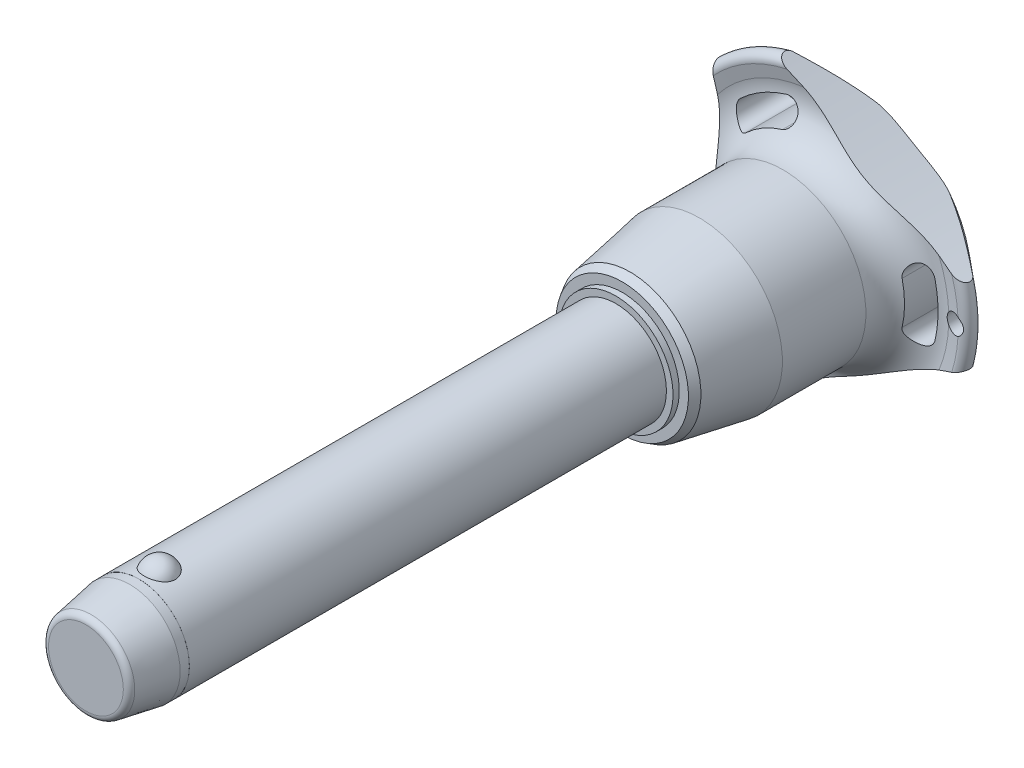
from build123d import *

# Parameters (mm, degrees)
SKETCH1_R           = 8
BOSS_EXTRUDE1_DEPTH = 70
SKETCH2_R           = 7
BOSS_EXTRUDE2_DEPTH = 39.7
BOSS_EXTRUDE3_START = 14
SKETCH1_2_R         = 8
BOSS_EXTRUDE3_DEPTH = 14
CHAMFER1_SIZE       = 7
CHAMFER1_SIZE2      = 1.234288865
FILLET1_R           = 1
SKETCH6_R           = 144.275
CUT_EXTRUDE1_DEPTH  = 115.750268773
CIRPATTERN1_COUNT   = 3
SKETCH7_R           = 1.5
CUT_EXTRUDE2_DEPTH  = 115.575242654
SKETCH8_R           = 8
SKETCH8_R_2         = 7.99
CUT_EXTRUDE3_DEPTH  = 8.4


with BuildPart() as part:
    # Sketch1 → Boss-Extrude1 (new body)
    with BuildSketch(Plane.XY):
        Circle(SKETCH1_R)
    extrude(amount=-BOSS_EXTRUDE1_DEPTH)

    # Sketch2 → Boss-Extrude2 (add)
    with BuildSketch(Plane(origin=(0, 0, -70), x_dir=(-1, 0, 0), z_dir=(0, 0, -1))):
        Circle(SKETCH2_R)
    extrude(amount=BOSS_EXTRUDE2_DEPTH)

    # Sketch3 → Revolve1 (revolve)
    with BuildSketch(Plane(origin=(0, 0, 0), x_dir=(0, 0, -1), z_dir=(1, 0, 0))):
        with BuildLine():
            Line((-2.387467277, 9.5), (-2.387467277, 4.2))
            ThreePointArc((-2.387467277, 4.2), (0.262532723, 6.85), (-2.387467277, 9.5))
        make_face()
        with BuildLine():
            Line((-2.387467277, -4.2), (-2.387467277, -9.5))
            ThreePointArc((-2.387467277, -9.5), (0.262532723, -6.85), (-2.387467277, -4.2))
        make_face()
    revolve(axis=Axis((0, -4.2, 2.387467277), (0, 1, 0)))

    # Sketch1_2 → Boss-Extrude3 (add)
    with BuildSketch(Plane.XY.offset(BOSS_EXTRUDE3_START)):
        Circle(SKETCH1_2_R)
    extrude(amount=-BOSS_EXTRUDE3_DEPTH)

    # Chamfer1
    chamfer1_edges = [part.edges().sort_by_distance(p)[0] for p in [
        (-8, 0, 14),
    ]]
    chamfer1_side = [part.faces().sort_by_distance(p)[0] for p in [
        (-8, 0, -28),
    ]]
    chamfer(chamfer1_edges, length=CHAMFER1_SIZE, length2=CHAMFER1_SIZE2, reference=chamfer1_side[0])

    # Fillet1
    fillet1_edges = [part.edges().sort_by_distance(p)[0] for p in [
        (-6.765711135, 0, 14),
        (7, 0, -109.7),
    ]]
    fillet(fillet1_edges, radius=FILLET1_R)

    # Sketch4 → Revolve2 (revolve)
    with BuildSketch(Plane(origin=(0, 0, 0), x_dir=(0, 0, -1), z_dir=(1, 0, 0)), mode=Mode.PRIVATE) as revolve2_sk:
        Polygon((70, 0), (70, 9.044607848), (71, 9.044607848), (71, 10.490707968), (72.25235944, 11.213758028), (83.233333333, 13.15), (96.466666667, 13.15), (96.466666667, 0), align=None)
    revolve(revolve2_sk.sketch.rotate(Axis((0, 0, -96.466666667), (0, 0, 1)), 90), axis=Axis((0, 0, -96.466666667), (0, 0, 1)))

    # Sketch5 → Revolve3 (revolve)
    with BuildSketch(Plane(origin=(0, 0, 0), x_dir=(0, 0, -1), z_dir=(1, 0, 0)), mode=Mode.PRIVATE) as revolve3_sk:
        with BuildLine():
            Line((102.32877039, 20.428960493), (101.910912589, 22.344207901))
            ThreePointArc((101.910912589, 22.344207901), (102.554394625, 23.677136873), (104.002586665, 23.371345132))
            Line((104.002586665, 23.371345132), (109.141488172, 17.247040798))
            ThreePointArc((109.141488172, 17.247040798), (109.7, 15.584758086), (108.978803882, 13.986322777))
            ThreePointArc((108.978803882, 13.986322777), (104.617427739, 7.589034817), (103.083333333, 0))
            Line((103.083333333, 0), (96.466666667, 0))
            Line((96.466666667, 0), (96.466666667, 13.15))
            ThreePointArc((96.466666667, 13.15), (101.139661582, 15.38660811), (102.32877039, 20.428960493))
        make_face()
    revolve(revolve3_sk.sketch.rotate(Axis((0, 0, -103.083333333), (0, 0, 1)), 90), axis=Axis((0, 0, -103.083333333), (0, 0, 1)))

    # Sketch6 → Cut-Extrude1 (cut, through all)
    with BuildSketch(Plane.XY):
        with Locations((-159.975, 0)):
            Circle(SKETCH6_R)
        with BuildLine():
            ThreePointArc((18.131206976, -4.190753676), (18.60922037, 0), (18.131206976, 4.190753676))
            ThreePointArc((18.131206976, 4.190753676), (15.94840906, 5.553949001), (14.585213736, 3.371151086))
            ThreePointArc((14.585213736, 3.371151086), (14.969740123, 0), (14.585213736, -3.371151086))
            ThreePointArc((14.585213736, -3.371151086), (15.94840906, -5.553949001), (18.131206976, -4.190753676))
        make_face()
    cut_extrude1 = extrude(amount=-CUT_EXTRUDE1_DEPTH, mode=Mode.SUBTRACT)

    # CirPattern1: Cut-Extrude1 ×3 about axis
    cirpattern1_axis = Axis((0, 0, 0), (0, 0, 1))
    for i in range(1, CIRPATTERN1_COUNT):
        add(cut_extrude1.rotate(cirpattern1_axis, i * 360 / CIRPATTERN1_COUNT), mode=Mode.SUBTRACT)

    # Sketch7 → Cut-Extrude2 (cut, through all)
    with BuildSketch(Plane.XY):
        with Locations(Location((21.60922037, 0, 0), (0, 0, 297.620773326))):
            Circle(SKETCH7_R)
    extrude(amount=-CUT_EXTRUDE2_DEPTH, mode=Mode.SUBTRACT)

    # Sketch8 → Cut-Extrude3 (cut)
    with BuildSketch(Plane.XY.offset(14)):
        Circle(SKETCH8_R)
        Circle(SKETCH8_R_2, mode=Mode.SUBTRACT)
    extrude(amount=-CUT_EXTRUDE3_DEPTH, mode=Mode.SUBTRACT)


solid = part.part
